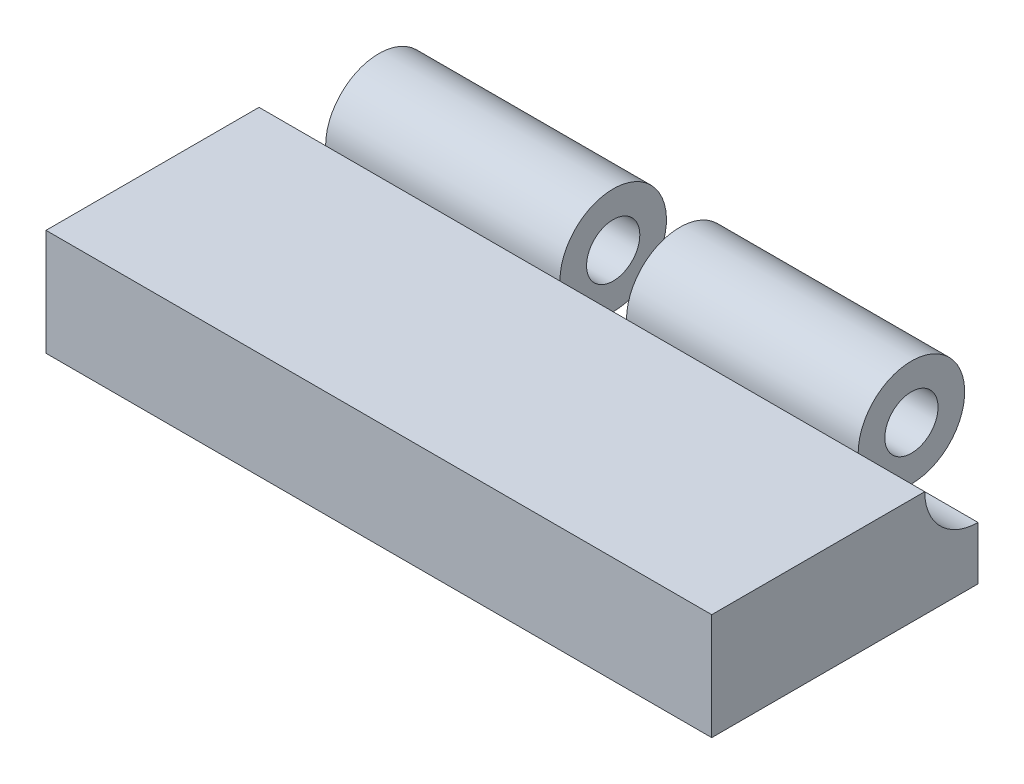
ISO-10303-21;
HEADER;
FILE_DESCRIPTION(('STEP AP214'),'2;1');
FILE_NAME('part.step','',(''),(''),'','','');
FILE_SCHEMA(('AUTOMOTIVE_DESIGN { 1 0 10303 214 1 1 1 1 }'));
ENDSEC;
DATA;
#1=APPLICATION_CONTEXT('core data for automotive mechanical design processes');
#2=APPLICATION_PROTOCOL_DEFINITION('international standard','automotive_design',2000,#1);
#3=PRODUCT_CONTEXT('',#1,'mechanical');
#4=PRODUCT('Part','Part','',(#3));
#5=PRODUCT_RELATED_PRODUCT_CATEGORY('part','',(#4));
#6=PRODUCT_DEFINITION_FORMATION('','',#4);
#7=PRODUCT_DEFINITION_CONTEXT('part definition',#1,'design');
#8=PRODUCT_DEFINITION('design','',#6,#7);
#9=PRODUCT_DEFINITION_SHAPE('','',#8);
#10=(LENGTH_UNIT() NAMED_UNIT(*) SI_UNIT(.MILLI.,.METRE.));
#11=(NAMED_UNIT(*) PLANE_ANGLE_UNIT() SI_UNIT($,.RADIAN.));
#12=(NAMED_UNIT(*) SI_UNIT($,.STERADIAN.) SOLID_ANGLE_UNIT());
#13=UNCERTAINTY_MEASURE_WITH_UNIT(LENGTH_MEASURE(1.E-05),#10,'distance_accuracy_value','');
#14=(GEOMETRIC_REPRESENTATION_CONTEXT(3) GLOBAL_UNCERTAINTY_ASSIGNED_CONTEXT((#13)) GLOBAL_UNIT_ASSIGNED_CONTEXT((#10,
#11,#12)) REPRESENTATION_CONTEXT('',''));
#15=CARTESIAN_POINT('',(0.,0.,0.));
#16=DIRECTION('',(0.,0.,1.));
#17=DIRECTION('',(1.,0.,0.));
#18=AXIS2_PLACEMENT_3D('',#15,#16,#17);
#19=CARTESIAN_POINT('',(-7.18420489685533,5.08,-12.7));
#20=DIRECTION('',(1.,0.,0.));
#21=DIRECTION('',(0.,0.,-1.));
#22=AXIS2_PLACEMENT_3D('',#19,#20,#21);
#23=CYLINDRICAL_SURFACE('',#22,2.54);
#24=DIRECTION('',(1.,0.,0.));
#25=VECTOR('',#24,1.);
#26=CARTESIAN_POINT('',(-7.18420489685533,5.08,-10.16));
#27=LINE('',#26,#25);
#28=CARTESIAN_POINT('',(14.351,5.08,-10.16));
#29=VERTEX_POINT('',#28);
#30=CARTESIAN_POINT('',(3.175,5.08,-10.16));
#31=VERTEX_POINT('',#30);
#32=EDGE_CURVE('E123',#29,#31,#27,.F.);
#33=ORIENTED_EDGE('',*,*,#32,.F.);
#34=CARTESIAN_POINT('',(14.351,5.08,-12.7));
#35=DIRECTION('',(1.,0.,0.));
#36=DIRECTION('',(0.,0.,-1.));
#37=AXIS2_PLACEMENT_3D('',#34,#35,#36);
#38=CIRCLE('',#37,2.54);
#39=CARTESIAN_POINT('',(14.351,2.54,-12.7));
#40=VERTEX_POINT('',#39);
#41=EDGE_CURVE('E260',#40,#29,#38,.T.);
#42=ORIENTED_EDGE('',*,*,#41,.F.);
#43=DIRECTION('',(1.,0.,0.));
#44=VECTOR('',#43,1.);
#45=CARTESIAN_POINT('',(-7.18420489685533,2.54,-12.7));
#46=LINE('',#45,#44);
#47=CARTESIAN_POINT('',(3.175,2.54,-12.7));
#48=VERTEX_POINT('',#47);
#49=EDGE_CURVE('E106',#48,#40,#46,.T.);
#50=ORIENTED_EDGE('',*,*,#49,.F.);
#51=CARTESIAN_POINT('',(3.175,5.08,-12.7));
#52=DIRECTION('',(1.,0.,0.));
#53=DIRECTION('',(0.,0.,-1.));
#54=AXIS2_PLACEMENT_3D('',#51,#52,#53);
#55=CIRCLE('',#54,2.54);
#56=EDGE_CURVE('E169',#31,#48,#55,.F.);
#57=ORIENTED_EDGE('',*,*,#56,.F.);
#58=EDGE_LOOP('',(#33,#42,#50,#57));
#59=FACE_BOUND('',#58,.T.);
#60=ADVANCED_FACE('F33',(#59),#23,.T.);
#61=CARTESIAN_POINT('',(31.75,5.08,-12.7));
#62=DIRECTION('',(-1.,0.,0.));
#63=DIRECTION('',(0.,0.,1.));
#64=AXIS2_PLACEMENT_3D('',#61,#62,#63);
#65=CYLINDRICAL_SURFACE('',#64,1.27);
#66=CARTESIAN_POINT('',(3.175,5.08,-12.7));
#67=DIRECTION('',(1.,0.,0.));
#68=DIRECTION('',(0.,0.,-1.));
#69=AXIS2_PLACEMENT_3D('',#66,#67,#68);
#70=CIRCLE('',#69,1.27);
#71=CARTESIAN_POINT('',(3.175,5.08,-13.97));
#72=VERTEX_POINT('',#71);
#73=EDGE_CURVE('E163',#72,#72,#70,.F.);
#74=ORIENTED_EDGE('',*,*,#73,.T.);
#75=EDGE_LOOP('',(#74));
#76=FACE_BOUND('',#75,.T.);
#77=CARTESIAN_POINT('',(14.351,5.08,-12.7));
#78=DIRECTION('',(1.,0.,0.));
#79=DIRECTION('',(0.,0.,-1.));
#80=AXIS2_PLACEMENT_3D('',#77,#78,#79);
#81=CIRCLE('',#80,1.27);
#82=CARTESIAN_POINT('',(14.351,5.08,-13.97));
#83=VERTEX_POINT('',#82);
#84=EDGE_CURVE('E126',#83,#83,#81,.T.);
#85=ORIENTED_EDGE('',*,*,#84,.T.);
#86=EDGE_LOOP('',(#85));
#87=FACE_BOUND('',#86,.T.);
#88=ADVANCED_FACE('F224',(#76,#87),#65,.F.);
#89=CARTESIAN_POINT('',(0.,5.08,-12.7));
#90=DIRECTION('',(0.,0.,1.));
#91=DIRECTION('',(1.,0.,0.));
#92=AXIS2_PLACEMENT_3D('',#89,#90,#91);
#93=PLANE('',#92);
#94=DIRECTION('',(0.,-1.,0.));
#95=VECTOR('',#94,1.);
#96=CARTESIAN_POINT('',(0.,5.08,-12.7));
#97=LINE('',#96,#95);
#98=CARTESIAN_POINT('',(0.,2.54,-12.7));
#99=VERTEX_POINT('',#98);
#100=CARTESIAN_POINT('',(0.,0.,-12.7));
#101=VERTEX_POINT('',#100);
#102=EDGE_CURVE('E78',#99,#101,#97,.T.);
#103=ORIENTED_EDGE('',*,*,#102,.F.);
#104=DIRECTION('',(-1.,0.,0.));
#105=VECTOR('',#104,1.);
#106=CARTESIAN_POINT('',(10.3592048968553,2.54,-12.7));
#107=LINE('',#106,#105);
#108=EDGE_CURVE('E150',#99,#48,#107,.F.);
#109=ORIENTED_EDGE('',*,*,#108,.T.);
#110=ORIENTED_EDGE('',*,*,#49,.T.);
#111=CARTESIAN_POINT('',(17.526,2.54,-12.7));
#112=VERTEX_POINT('',#111);
#113=EDGE_CURVE('E110',#40,#112,#46,.T.);
#114=ORIENTED_EDGE('',*,*,#113,.T.);
#115=CARTESIAN_POINT('',(28.575,2.54,-12.7));
#116=VERTEX_POINT('',#115);
#117=EDGE_CURVE('E112',#112,#116,#46,.T.);
#118=ORIENTED_EDGE('',*,*,#117,.T.);
#119=DIRECTION('',(1.,0.,0.));
#120=VECTOR('',#119,1.);
#121=CARTESIAN_POINT('',(21.3907951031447,2.54,-12.7));
#122=LINE('',#121,#120);
#123=CARTESIAN_POINT('',(31.75,2.54,-12.7));
#124=VERTEX_POINT('',#123);
#125=EDGE_CURVE('E161',#116,#124,#122,.T.);
#126=ORIENTED_EDGE('',*,*,#125,.T.);
#127=DIRECTION('',(0.,-1.,0.));
#128=VECTOR('',#127,1.);
#129=CARTESIAN_POINT('',(31.75,5.08,-12.7));
#130=LINE('',#129,#128);
#131=CARTESIAN_POINT('',(31.75,0.,-12.7));
#132=VERTEX_POINT('',#131);
#133=EDGE_CURVE('E89',#124,#132,#130,.T.);
#134=ORIENTED_EDGE('',*,*,#133,.T.);
#135=DIRECTION('',(-1.,0.,0.));
#136=VECTOR('',#135,1.);
#137=CARTESIAN_POINT('',(0.,0.,-12.7));
#138=LINE('',#137,#136);
#139=EDGE_CURVE('E93',#132,#101,#138,.T.);
#140=ORIENTED_EDGE('',*,*,#139,.T.);
#141=EDGE_LOOP('',(#103,#109,#110,#114,#118,#126,#134,#140));
#142=FACE_BOUND('',#141,.T.);
#143=ADVANCED_FACE('F94',(#142),#93,.F.);
#144=CARTESIAN_POINT('',(0.,5.08,-12.7));
#145=DIRECTION('',(0.,-1.,0.));
#146=DIRECTION('',(0.,0.,-1.));
#147=AXIS2_PLACEMENT_3D('',#144,#145,#146);
#148=PLANE('',#147);
#149=CARTESIAN_POINT('',(28.575,5.08,-10.16));
#150=VERTEX_POINT('',#149);
#151=CARTESIAN_POINT('',(17.526,5.08,-10.16));
#152=VERTEX_POINT('',#151);
#153=EDGE_CURVE('E42',#150,#152,#27,.F.);
#154=ORIENTED_EDGE('',*,*,#153,.T.);
#155=EDGE_CURVE('E125',#152,#29,#27,.F.);
#156=ORIENTED_EDGE('',*,*,#155,.T.);
#157=ORIENTED_EDGE('',*,*,#32,.T.);
#158=DIRECTION('',(-1.,0.,0.));
#159=VECTOR('',#158,1.);
#160=CARTESIAN_POINT('',(10.3592048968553,5.08,-10.16));
#161=LINE('',#160,#159);
#162=CARTESIAN_POINT('',(0.,5.08,-10.16));
#163=VERTEX_POINT('',#162);
#164=EDGE_CURVE('E147',#31,#163,#161,.T.);
#165=ORIENTED_EDGE('',*,*,#164,.T.);
#166=DIRECTION('',(0.,0.,1.));
#167=VECTOR('',#166,1.);
#168=CARTESIAN_POINT('',(0.,5.08,0.));
#169=LINE('',#168,#167);
#170=CARTESIAN_POINT('',(0.,5.08,0.));
#171=VERTEX_POINT('',#170);
#172=EDGE_CURVE('E100',#163,#171,#169,.T.);
#173=ORIENTED_EDGE('',*,*,#172,.T.);
#174=DIRECTION('',(1.,0.,0.));
#175=VECTOR('',#174,1.);
#176=CARTESIAN_POINT('',(0.,5.08,0.));
#177=LINE('',#176,#175);
#178=CARTESIAN_POINT('',(31.75,5.08,0.));
#179=VERTEX_POINT('',#178);
#180=EDGE_CURVE('E58',#171,#179,#177,.T.);
#181=ORIENTED_EDGE('',*,*,#180,.T.);
#182=DIRECTION('',(0.,0.,-1.));
#183=VECTOR('',#182,1.);
#184=CARTESIAN_POINT('',(31.75,5.08,0.));
#185=LINE('',#184,#183);
#186=CARTESIAN_POINT('',(31.75,5.08,-10.16));
#187=VERTEX_POINT('',#186);
#188=EDGE_CURVE('E90',#179,#187,#185,.T.);
#189=ORIENTED_EDGE('',*,*,#188,.T.);
#190=DIRECTION('',(1.,0.,0.));
#191=VECTOR('',#190,1.);
#192=CARTESIAN_POINT('',(21.3907951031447,5.08,-10.16));
#193=LINE('',#192,#191);
#194=EDGE_CURVE('E158',#187,#150,#193,.F.);
#195=ORIENTED_EDGE('',*,*,#194,.T.);
#196=EDGE_LOOP('',(#154,#156,#157,#165,#173,#181,#189,#195));
#197=FACE_BOUND('',#196,.T.);
#198=ADVANCED_FACE('F174',(#197),#148,.F.);
#199=CARTESIAN_POINT('',(0.,5.08,0.));
#200=DIRECTION('',(1.,0.,0.));
#201=DIRECTION('',(0.,0.,-1.));
#202=AXIS2_PLACEMENT_3D('',#199,#200,#201);
#203=PLANE('',#202);
#204=ORIENTED_EDGE('',*,*,#172,.F.);
#205=CARTESIAN_POINT('',(0.,5.08,-12.7));
#206=DIRECTION('',(-1.,0.,0.));
#207=DIRECTION('',(0.,0.,1.));
#208=AXIS2_PLACEMENT_3D('',#205,#206,#207);
#209=CIRCLE('',#208,2.54);
#210=EDGE_CURVE('E86',#99,#163,#209,.T.);
#211=ORIENTED_EDGE('',*,*,#210,.F.);
#212=ORIENTED_EDGE('',*,*,#102,.T.);
#213=DIRECTION('',(0.,0.,1.));
#214=VECTOR('',#213,1.);
#215=CARTESIAN_POINT('',(0.,0.,0.));
#216=LINE('',#215,#214);
#217=CARTESIAN_POINT('',(0.,0.,0.));
#218=VERTEX_POINT('',#217);
#219=EDGE_CURVE('E83',#101,#218,#216,.T.);
#220=ORIENTED_EDGE('',*,*,#219,.T.);
#221=DIRECTION('',(0.,-1.,0.));
#222=VECTOR('',#221,1.);
#223=CARTESIAN_POINT('',(0.,5.08,0.));
#224=LINE('',#223,#222);
#225=EDGE_CURVE('E121',#171,#218,#224,.T.);
#226=ORIENTED_EDGE('',*,*,#225,.F.);
#227=EDGE_LOOP('',(#204,#211,#212,#220,#226));
#228=FACE_BOUND('',#227,.T.);
#229=ADVANCED_FACE('F35',(#228),#203,.F.);
#230=CARTESIAN_POINT('',(31.75,5.08,0.));
#231=DIRECTION('',(-1.,0.,0.));
#232=DIRECTION('',(0.,0.,1.));
#233=AXIS2_PLACEMENT_3D('',#230,#231,#232);
#234=PLANE('',#233);
#235=ORIENTED_EDGE('',*,*,#133,.F.);
#236=CARTESIAN_POINT('',(31.75,5.08,-12.7));
#237=DIRECTION('',(1.,0.,0.));
#238=DIRECTION('',(0.,0.,-1.));
#239=AXIS2_PLACEMENT_3D('',#236,#237,#238);
#240=CIRCLE('',#239,2.54);
#241=EDGE_CURVE('E152',#187,#124,#240,.T.);
#242=ORIENTED_EDGE('',*,*,#241,.F.);
#243=ORIENTED_EDGE('',*,*,#188,.F.);
#244=DIRECTION('',(0.,-1.,0.));
#245=VECTOR('',#244,1.);
#246=CARTESIAN_POINT('',(31.75,5.08,0.));
#247=LINE('',#246,#245);
#248=CARTESIAN_POINT('',(31.75,0.,0.));
#249=VERTEX_POINT('',#248);
#250=EDGE_CURVE('E118',#179,#249,#247,.T.);
#251=ORIENTED_EDGE('',*,*,#250,.T.);
#252=DIRECTION('',(0.,0.,-1.));
#253=VECTOR('',#252,1.);
#254=CARTESIAN_POINT('',(31.75,0.,0.));
#255=LINE('',#254,#253);
#256=EDGE_CURVE('E101',#249,#132,#255,.T.);
#257=ORIENTED_EDGE('',*,*,#256,.T.);
#258=EDGE_LOOP('',(#235,#242,#243,#251,#257));
#259=FACE_BOUND('',#258,.T.);
#260=ADVANCED_FACE('F183',(#259),#234,.F.);
#261=CARTESIAN_POINT('',(3.175,5.08,0.));
#262=DIRECTION('',(1.,0.,0.));
#263=DIRECTION('',(0.,0.,-1.));
#264=AXIS2_PLACEMENT_3D('',#261,#262,#263);
#265=PLANE('',#264);
#266=ORIENTED_EDGE('',*,*,#73,.F.);
#267=EDGE_LOOP('',(#266));
#268=FACE_BOUND('',#267,.T.);
#269=ORIENTED_EDGE('',*,*,#56,.T.);
#270=CARTESIAN_POINT('',(3.175,5.08,-12.7));
#271=DIRECTION('',(1.,0.,0.));
#272=DIRECTION('',(0.,0.,-1.));
#273=AXIS2_PLACEMENT_3D('',#270,#271,#272);
#274=CIRCLE('',#273,2.54);
#275=EDGE_CURVE('E144',#48,#31,#274,.F.);
#276=ORIENTED_EDGE('',*,*,#275,.T.);
#277=EDGE_LOOP('',(#269,#276));
#278=FACE_BOUND('',#277,.T.);
#279=ADVANCED_FACE('F216',(#268,#278),#265,.F.);
#280=CARTESIAN_POINT('',(28.575,5.08,0.));
#281=DIRECTION('',(-1.,0.,0.));
#282=DIRECTION('',(0.,0.,1.));
#283=AXIS2_PLACEMENT_3D('',#280,#281,#282);
#284=PLANE('',#283);
#285=CARTESIAN_POINT('',(28.575,5.08,-12.7));
#286=DIRECTION('',(-1.,0.,0.));
#287=DIRECTION('',(0.,0.,1.));
#288=AXIS2_PLACEMENT_3D('',#285,#286,#287);
#289=CIRCLE('',#288,2.54);
#290=EDGE_CURVE('E155',#150,#116,#289,.F.);
#291=ORIENTED_EDGE('',*,*,#290,.T.);
#292=CARTESIAN_POINT('',(28.575,5.08,-12.7));
#293=DIRECTION('',(-1.,0.,0.));
#294=DIRECTION('',(0.,0.,1.));
#295=AXIS2_PLACEMENT_3D('',#292,#293,#294);
#296=CIRCLE('',#295,2.54);
#297=EDGE_CURVE('E166',#150,#116,#296,.T.);
#298=ORIENTED_EDGE('',*,*,#297,.F.);
#299=EDGE_LOOP('',(#291,#298));
#300=FACE_BOUND('',#299,.T.);
#301=CARTESIAN_POINT('',(28.575,5.08,-12.7));
#302=DIRECTION('',(-1.,0.,0.));
#303=DIRECTION('',(0.,0.,1.));
#304=AXIS2_PLACEMENT_3D('',#301,#302,#303);
#305=CIRCLE('',#304,1.27);
#306=CARTESIAN_POINT('',(28.575,5.08,-11.43));
#307=VERTEX_POINT('',#306);
#308=EDGE_CURVE('E12',#307,#307,#305,.F.);
#309=ORIENTED_EDGE('',*,*,#308,.F.);
#310=EDGE_LOOP('',(#309));
#311=FACE_BOUND('',#310,.T.);
#312=ADVANCED_FACE('F212',(#300,#311),#284,.F.);
#313=CARTESIAN_POINT('',(0.,5.08,0.));
#314=DIRECTION('',(0.,0.,-1.));
#315=DIRECTION('',(-1.,0.,0.));
#316=AXIS2_PLACEMENT_3D('',#313,#314,#315);
#317=PLANE('',#316);
#318=DIRECTION('',(1.,0.,0.));
#319=VECTOR('',#318,1.);
#320=CARTESIAN_POINT('',(0.,0.,0.));
#321=LINE('',#320,#319);
#322=EDGE_CURVE('E104',#218,#249,#321,.T.);
#323=ORIENTED_EDGE('',*,*,#322,.T.);
#324=ORIENTED_EDGE('',*,*,#250,.F.);
#325=ORIENTED_EDGE('',*,*,#180,.F.);
#326=ORIENTED_EDGE('',*,*,#225,.T.);
#327=EDGE_LOOP('',(#323,#324,#325,#326));
#328=FACE_BOUND('',#327,.T.);
#329=ADVANCED_FACE('F215',(#328),#317,.F.);
#330=CARTESIAN_POINT('',(0.,0.,-12.7));
#331=DIRECTION('',(0.,-1.,0.));
#332=DIRECTION('',(0.,0.,-1.));
#333=AXIS2_PLACEMENT_3D('',#330,#331,#332);
#334=PLANE('',#333);
#335=ORIENTED_EDGE('',*,*,#219,.F.);
#336=ORIENTED_EDGE('',*,*,#139,.F.);
#337=ORIENTED_EDGE('',*,*,#256,.F.);
#338=ORIENTED_EDGE('',*,*,#322,.F.);
#339=EDGE_LOOP('',(#335,#336,#337,#338));
#340=FACE_BOUND('',#339,.T.);
#341=ADVANCED_FACE('F103',(#340),#334,.T.);
#342=CARTESIAN_POINT('',(17.526,5.08,-12.7));
#343=DIRECTION('',(1.,0.,0.));
#344=DIRECTION('',(0.,0.,-1.));
#345=AXIS2_PLACEMENT_3D('',#342,#343,#344);
#346=CIRCLE('',#345,2.54);
#347=EDGE_CURVE('E133',#112,#152,#346,.T.);
#348=ORIENTED_EDGE('',*,*,#347,.T.);
#349=ORIENTED_EDGE('',*,*,#153,.F.);
#350=ORIENTED_EDGE('',*,*,#297,.T.);
#351=ORIENTED_EDGE('',*,*,#117,.F.);
#352=EDGE_LOOP('',(#348,#349,#350,#351));
#353=FACE_BOUND('',#352,.T.);
#354=ADVANCED_FACE('F192',(#353),#23,.T.);
#355=CARTESIAN_POINT('',(17.526,5.08,-12.7));
#356=DIRECTION('',(1.,0.,0.));
#357=DIRECTION('',(0.,0.,-1.));
#358=AXIS2_PLACEMENT_3D('',#355,#356,#357);
#359=CIRCLE('',#358,1.27);
#360=CARTESIAN_POINT('',(17.526,5.08,-13.97));
#361=VERTEX_POINT('',#360);
#362=EDGE_CURVE('E37',#361,#361,#359,.T.);
#363=ORIENTED_EDGE('',*,*,#362,.F.);
#364=EDGE_LOOP('',(#363));
#365=FACE_BOUND('',#364,.T.);
#366=ORIENTED_EDGE('',*,*,#308,.T.);
#367=EDGE_LOOP('',(#366));
#368=FACE_BOUND('',#367,.T.);
#369=ADVANCED_FACE('F220',(#365,#368),#65,.F.);
#370=CARTESIAN_POINT('',(21.3907951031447,5.08,-12.7));
#371=DIRECTION('',(1.,0.,0.));
#372=DIRECTION('',(0.,0.,-1.));
#373=AXIS2_PLACEMENT_3D('',#370,#371,#372);
#374=CYLINDRICAL_SURFACE('',#373,2.54);
#375=ORIENTED_EDGE('',*,*,#290,.F.);
#376=ORIENTED_EDGE('',*,*,#194,.F.);
#377=ORIENTED_EDGE('',*,*,#241,.T.);
#378=ORIENTED_EDGE('',*,*,#125,.F.);
#379=EDGE_LOOP('',(#375,#376,#377,#378));
#380=FACE_BOUND('',#379,.T.);
#381=ADVANCED_FACE('F187',(#380),#374,.F.);
#382=CARTESIAN_POINT('',(10.3592048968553,5.08,-12.7));
#383=DIRECTION('',(-1.,0.,0.));
#384=DIRECTION('',(0.,0.,1.));
#385=AXIS2_PLACEMENT_3D('',#382,#383,#384);
#386=CYLINDRICAL_SURFACE('',#385,2.54);
#387=ORIENTED_EDGE('',*,*,#210,.T.);
#388=ORIENTED_EDGE('',*,*,#164,.F.);
#389=ORIENTED_EDGE('',*,*,#275,.F.);
#390=ORIENTED_EDGE('',*,*,#108,.F.);
#391=EDGE_LOOP('',(#387,#388,#389,#390));
#392=FACE_BOUND('',#391,.T.);
#393=ADVANCED_FACE('F229',(#392),#386,.F.);
#394=CARTESIAN_POINT('',(17.526,5.08,-12.7));
#395=DIRECTION('',(-1.,0.,0.));
#396=DIRECTION('',(0.,0.,1.));
#397=AXIS2_PLACEMENT_3D('',#394,#395,#396);
#398=CYLINDRICAL_SURFACE('',#397,2.54);
#399=ORIENTED_EDGE('',*,*,#113,.F.);
#400=EDGE_CURVE('E49',#29,#40,#38,.T.);
#401=ORIENTED_EDGE('',*,*,#400,.F.);
#402=ORIENTED_EDGE('',*,*,#155,.F.);
#403=EDGE_CURVE('E128',#152,#112,#346,.T.);
#404=ORIENTED_EDGE('',*,*,#403,.T.);
#405=EDGE_LOOP('',(#399,#401,#402,#404));
#406=FACE_BOUND('',#405,.T.);
#407=ADVANCED_FACE('F262',(#406),#398,.F.);
#408=CARTESIAN_POINT('',(17.526,5.08,-12.7));
#409=DIRECTION('',(1.,0.,0.));
#410=DIRECTION('',(0.,0.,-1.));
#411=AXIS2_PLACEMENT_3D('',#408,#409,#410);
#412=PLANE('',#411);
#413=ORIENTED_EDGE('',*,*,#362,.T.);
#414=EDGE_LOOP('',(#413));
#415=FACE_BOUND('',#414,.T.);
#416=ORIENTED_EDGE('',*,*,#403,.F.);
#417=ORIENTED_EDGE('',*,*,#347,.F.);
#418=EDGE_LOOP('',(#416,#417));
#419=FACE_BOUND('',#418,.T.);
#420=ADVANCED_FACE('F263',(#415,#419),#412,.F.);
#421=CARTESIAN_POINT('',(14.351,5.08,-12.7));
#422=DIRECTION('',(1.,0.,0.));
#423=DIRECTION('',(0.,0.,-1.));
#424=AXIS2_PLACEMENT_3D('',#421,#422,#423);
#425=PLANE('',#424);
#426=ORIENTED_EDGE('',*,*,#84,.F.);
#427=EDGE_LOOP('',(#426));
#428=FACE_BOUND('',#427,.T.);
#429=ORIENTED_EDGE('',*,*,#400,.T.);
#430=ORIENTED_EDGE('',*,*,#41,.T.);
#431=EDGE_LOOP('',(#429,#430));
#432=FACE_BOUND('',#431,.T.);
#433=ADVANCED_FACE('F261',(#428,#432),#425,.T.);
#434=CLOSED_SHELL('',(#60,#88,#143,#198,#229,#260,#279,#312,#329,#341,#354,#369,#381,#393,#407,
#420,#433));
#435=MANIFOLD_SOLID_BREP('B2',#434);
#436=ADVANCED_BREP_SHAPE_REPRESENTATION('',(#18,#435),#14);
#437=SHAPE_DEFINITION_REPRESENTATION(#9,#436);
ENDSEC;
END-ISO-10303-21;
